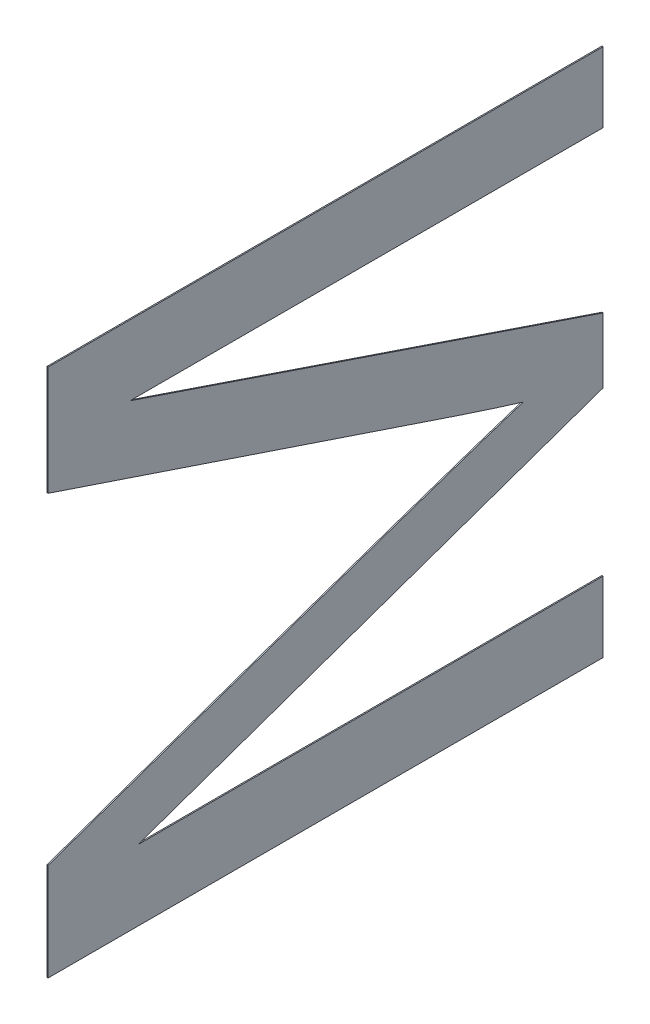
ISO-10303-21;
HEADER;
FILE_DESCRIPTION(('STEP AP214'),'2;1');
FILE_NAME('part.step','',(''),(''),'','','');
FILE_SCHEMA(('AUTOMOTIVE_DESIGN { 1 0 10303 214 1 1 1 1 }'));
ENDSEC;
DATA;
#1=APPLICATION_CONTEXT('core data for automotive mechanical design processes');
#2=APPLICATION_PROTOCOL_DEFINITION('international standard','automotive_design',2000,#1);
#3=PRODUCT_CONTEXT('',#1,'mechanical');
#4=PRODUCT('Part','Part','',(#3));
#5=PRODUCT_RELATED_PRODUCT_CATEGORY('part','',(#4));
#6=PRODUCT_DEFINITION_FORMATION('','',#4);
#7=PRODUCT_DEFINITION_CONTEXT('part definition',#1,'design');
#8=PRODUCT_DEFINITION('design','',#6,#7);
#9=PRODUCT_DEFINITION_SHAPE('','',#8);
#10=(LENGTH_UNIT() NAMED_UNIT(*) SI_UNIT(.MILLI.,.METRE.));
#11=(NAMED_UNIT(*) PLANE_ANGLE_UNIT() SI_UNIT($,.RADIAN.));
#12=(NAMED_UNIT(*) SI_UNIT($,.STERADIAN.) SOLID_ANGLE_UNIT());
#13=UNCERTAINTY_MEASURE_WITH_UNIT(LENGTH_MEASURE(1.E-05),#10,'distance_accuracy_value','');
#14=(GEOMETRIC_REPRESENTATION_CONTEXT(3) GLOBAL_UNCERTAINTY_ASSIGNED_CONTEXT((#13)) GLOBAL_UNIT_ASSIGNED_CONTEXT((#10,
#11,#12)) REPRESENTATION_CONTEXT('',''));
#15=CARTESIAN_POINT('',(0.,0.,0.));
#16=DIRECTION('',(0.,0.,1.));
#17=DIRECTION('',(1.,0.,0.));
#18=AXIS2_PLACEMENT_3D('',#15,#16,#17);
#19=CARTESIAN_POINT('',(-5.55,3.131661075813,19.957638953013));
#20=DIRECTION('',(-1.,0.,0.));
#21=DIRECTION('',(0.,-1.,0.));
#22=AXIS2_PLACEMENT_3D('',#19,#20,#21);
#23=PLANE('',#22);
#24=DIRECTION('',(0.,0.,1.));
#25=VECTOR('',#24,1.);
#26=CARTESIAN_POINT('',(-5.55,4.777331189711,17.19421221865));
#27=LINE('',#26,#25);
#28=CARTESIAN_POINT('',(-5.55,4.777331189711,22.023794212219));
#29=VERTEX_POINT('',#28);
#30=CARTESIAN_POINT('',(-5.55,4.777331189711,17.19421221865));
#31=VERTEX_POINT('',#30);
#32=EDGE_CURVE('E236',#29,#31,#27,.F.);
#33=ORIENTED_EDGE('',*,*,#32,.F.);
#34=DIRECTION('',(0.,1.,0.));
#35=VECTOR('',#34,1.);
#36=CARTESIAN_POINT('',(-5.55,4.777331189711,22.023794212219));
#37=LINE('',#36,#35);
#38=CARTESIAN_POINT('',(-5.55,3.825562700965,22.023794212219));
#39=VERTEX_POINT('',#38);
#40=EDGE_CURVE('E122',#39,#29,#37,.T.);
#41=ORIENTED_EDGE('',*,*,#40,.F.);
#42=CARTESIAN_POINT('',(-5.55,2.44614147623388,17.8887459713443));
#43=CARTESIAN_POINT('',(-5.55,2.44809287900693,17.8951206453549));
#44=CARTESIAN_POINT('',(-5.55,2.45004737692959,17.9014943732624));
#45=CARTESIAN_POINT('',(-5.55,2.45983523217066,17.933358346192));
#46=CARTESIAN_POINT('',(-5.55,2.46771464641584,17.9588344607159));
#47=CARTESIAN_POINT('',(-5.55,2.48356856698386,18.009757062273));
#48=CARTESIAN_POINT('',(-5.55,2.49154307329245,18.0352035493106));
#49=CARTESIAN_POINT('',(-5.55,2.50758154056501,18.0860683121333));
#50=CARTESIAN_POINT('',(-5.55,2.51564550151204,18.1114865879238));
#51=CARTESIAN_POINT('',(-5.55,2.52780433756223,18.1495938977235));
#52=CARTESIAN_POINT('',(-5.55,2.53186776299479,18.1622929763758));
#53=CARTESIAN_POINT('',(-5.55,2.54001489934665,18.1876846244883));
#54=CARTESIAN_POINT('',(-5.55,2.54409861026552,18.2003771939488));
#55=CARTESIAN_POINT('',(-5.55,2.55637927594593,18.2384454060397));
#56=CARTESIAN_POINT('',(-5.55,2.56460575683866,18.2638115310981));
#57=CARTESIAN_POINT('',(-5.55,2.57700046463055,18.3018427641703));
#58=CARTESIAN_POINT('',(-5.55,2.58114119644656,18.3145168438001));
#59=CARTESIAN_POINT('',(-5.55,2.59359114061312,18.3525300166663));
#60=CARTESIAN_POINT('',(-5.55,2.60192809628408,18.3778600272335));
#61=CARTESIAN_POINT('',(-5.55,2.61865762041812,18.4285016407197));
#62=CARTESIAN_POINT('',(-5.55,2.62705018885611,18.4538132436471));
#63=CARTESIAN_POINT('',(-5.55,2.6438728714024,18.5044239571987));
#64=CARTESIAN_POINT('',(-5.55,2.65230298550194,18.5297230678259));
#65=CARTESIAN_POINT('',(-5.55,2.66919054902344,18.5803121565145));
#66=CARTESIAN_POINT('',(-5.55,2.67764799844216,18.6056021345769));
#67=CARTESIAN_POINT('',(-5.55,2.69457980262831,18.6561764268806));
#68=CARTESIAN_POINT('',(-5.55,2.70305415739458,18.6814607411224));
#69=CARTESIAN_POINT('',(-5.55,2.72001465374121,18.7320254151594));
#70=CARTESIAN_POINT('',(-5.55,2.72850079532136,18.7573057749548));
#71=CARTESIAN_POINT('',(-5.55,2.74548242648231,18.8078633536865));
#72=CARTESIAN_POINT('',(-5.55,2.75397791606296,18.8331405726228));
#73=CARTESIAN_POINT('',(-5.55,2.76672334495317,18.8710556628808));
#74=CARTESIAN_POINT('',(-5.55,2.77097218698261,18.8836939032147));
#75=CARTESIAN_POINT('',(-5.55,2.78371800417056,18.9216088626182));
#76=CARTESIAN_POINT('',(-5.55,2.79221427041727,18.9468858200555));
#77=CARTESIAN_POINT('',(-5.55,2.8092032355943,18.9974409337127));
#78=CARTESIAN_POINT('',(-5.55,2.8176959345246,19.0227190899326));
#79=CARTESIAN_POINT('',(-5.55,2.83043336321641,19.0606368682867));
#80=CARTESIAN_POINT('',(-5.55,2.8346789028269,19.0732762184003));
#81=CARTESIAN_POINT('',(-5.55,2.84741477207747,19.1111945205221));
#82=CARTESIAN_POINT('',(-5.55,2.85590435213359,19.136473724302));
#83=CARTESIAN_POINT('',(-5.55,2.87288220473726,19.1870325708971));
#84=CARTESIAN_POINT('',(-5.55,2.8813704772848,19.2123122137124));
#85=CARTESIAN_POINT('',(-5.55,2.8941023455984,19.2502318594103));
#86=CARTESIAN_POINT('',(-5.55,2.89834621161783,19.262871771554));
#87=CARTESIAN_POINT('',(-5.55,2.91107765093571,19.3007915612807));
#88=CARTESIAN_POINT('',(-5.55,2.91956506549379,19.3260714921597));
#89=CARTESIAN_POINT('',(-5.55,2.93654002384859,19.3766313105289));
#90=CARTESIAN_POINT('',(-5.55,2.94502756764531,19.4019111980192));
#91=CARTESIAN_POINT('',(-5.55,2.96200341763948,19.4524707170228));
#92=CARTESIAN_POINT('',(-5.55,2.97049172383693,19.4777503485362));
#93=CARTESIAN_POINT('',(-5.55,2.98322474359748,19.5156696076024));
#94=CARTESIAN_POINT('',(-5.55,2.98746917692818,19.5283093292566));
#95=CARTESIAN_POINT('',(-5.55,3.00020271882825,19.5662284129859));
#96=CARTESIAN_POINT('',(-5.55,3.00869206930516,19.5915076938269));
#97=CARTESIAN_POINT('',(-5.55,3.02567128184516,19.6420660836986));
#98=CARTESIAN_POINT('',(-5.55,3.03416114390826,19.6673451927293));
#99=CARTESIAN_POINT('',(-5.55,3.04689621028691,19.705263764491));
#100=CARTESIAN_POINT('',(-5.55,3.05114127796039,19.7179032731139));
#101=CARTESIAN_POINT('',(-5.55,3.06387659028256,19.7558217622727));
#102=CARTESIAN_POINT('',(-5.55,3.07236694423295,19.7811007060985));
#103=CARTESIAN_POINT('',(-5.55,3.08934779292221,19.8316585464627));
#104=CARTESIAN_POINT('',(-5.55,3.09783828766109,19.8569374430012));
#105=CARTESIAN_POINT('',(-5.55,3.11057402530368,19.8948557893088));
#106=CARTESIAN_POINT('',(-5.55,3.11481927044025,19.9074952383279));
#107=CARTESIAN_POINT('',(-5.55,3.12755496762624,19.9454135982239));
#108=CARTESIAN_POINT('',(-5.55,3.1360453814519,19.9706925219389));
#109=CARTESIAN_POINT('',(-5.55,3.15302604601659,20.0212504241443));
#110=CARTESIAN_POINT('',(-5.55,3.16151629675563,20.0465294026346));
#111=CARTESIAN_POINT('',(-5.55,3.17849666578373,20.0970874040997));
#112=CARTESIAN_POINT('',(-5.55,3.18698678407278,20.1223664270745));
#113=CARTESIAN_POINT('',(-5.55,3.19972187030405,20.1602849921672));
#114=CARTESIAN_POINT('',(-5.55,3.20396688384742,20.1729245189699));
#115=CARTESIAN_POINT('',(-5.55,3.21670188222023,20.21084311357));
#116=CARTESIAN_POINT('',(-5.55,3.22519182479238,20.2361221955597));
#117=CARTESIAN_POINT('',(-5.55,3.24217161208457,20.2866803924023));
#118=CARTESIAN_POINT('',(-5.55,3.25066145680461,20.3119595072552));
#119=CARTESIAN_POINT('',(-5.55,3.26339616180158,20.3498782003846));
#120=CARTESIAN_POINT('',(-5.55,3.26764105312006,20.3625177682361));
#121=CARTESIAN_POINT('',(-5.55,3.28037569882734,20.4004364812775));
#122=CARTESIAN_POINT('',(-5.55,3.28886542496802,20.4257156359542));
#123=CARTESIAN_POINT('',(-5.55,3.3058448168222,20.4762739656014));
#124=CARTESIAN_POINT('',(-5.55,3.31433448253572,20.5015531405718));
#125=CARTESIAN_POINT('',(-5.55,3.33131376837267,20.5521115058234));
#126=CARTESIAN_POINT('',(-5.55,3.33980338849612,20.5773906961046));
#127=CARTESIAN_POINT('',(-5.55,3.35253779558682,20.6153094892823));
#128=CARTESIAN_POINT('',(-5.55,3.35678259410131,20.6279490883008));
#129=CARTESIAN_POINT('',(-5.55,3.3695169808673,20.6658678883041));
#130=CARTESIAN_POINT('',(-5.55,3.3780065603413,20.6911470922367));
#131=CARTESIAN_POINT('',(-5.55,3.39498571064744,20.7417055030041));
#132=CARTESIAN_POINT('',(-5.55,3.40347528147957,20.766984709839));
#133=CARTESIAN_POINT('',(-5.55,3.4162096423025,20.8049035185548));
#134=CARTESIAN_POINT('',(-5.55,3.42045443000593,20.8175431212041));
#135=CARTESIAN_POINT('',(-5.55,3.43318879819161,20.8554619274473));
#136=CARTESIAN_POINT('',(-5.55,3.44167838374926,20.8807411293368));
#137=CARTESIAN_POINT('',(-5.55,3.4586575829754,20.9312995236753));
#138=CARTESIAN_POINT('',(-5.55,3.46714719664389,20.9565787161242));
#139=CARTESIAN_POINT('',(-5.55,3.47988164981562,20.9944974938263));
#140=CARTESIAN_POINT('',(-5.55,3.48412647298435,21.0071370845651));
#141=CARTESIAN_POINT('',(-5.55000000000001,3.49686095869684,21.0450558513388));
#142=CARTESIAN_POINT('',(-5.55,3.50535063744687,21.0703350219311));
#143=CARTESIAN_POINT('',(-5.55,3.51808518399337,21.1082537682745));
#144=CARTESIAN_POINT('',(-5.55,3.52233003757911,21.1208933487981));
#145=CARTESIAN_POINT('',(-5.55,3.5350646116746,21.1588120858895));
#146=CARTESIAN_POINT('',(-5.55,3.54355434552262,21.1840912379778));
#147=CARTESIAN_POINT('',(-5.55,3.55628896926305,21.2220099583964));
#148=CARTESIAN_POINT('',(-5.55,3.56053384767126,21.2346495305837));
#149=CARTESIAN_POINT('',(-5.55,3.57326849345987,21.2725682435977));
#150=CARTESIAN_POINT('',(-5.55,3.58175827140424,21.2978473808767));
#151=CARTESIAN_POINT('',(-5.55,3.59449295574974,21.3357660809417));
#152=CARTESIAN_POINT('',(-5.55,3.59873785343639,21.3484056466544));
#153=CARTESIAN_POINT('',(-5.55,3.61147255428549,21.3863243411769));
#154=CARTESIAN_POINT('',(-5.55,3.61996236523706,21.4116034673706));
#155=CARTESIAN_POINT('',(-5.55,3.63694200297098,21.4621617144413));
#156=CARTESIAN_POINT('',(-5.55,3.64543182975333,21.4874408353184));
#157=CARTESIAN_POINT('',(-5.55,3.65816657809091,21.5253595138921));
#158=CARTESIAN_POINT('',(-5.55,3.66241149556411,21.5379990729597));
#159=CARTESIAN_POINT('',(-5.55,3.67514625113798,21.5759177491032));
#160=CARTESIAN_POINT('',(-5.55,3.68363609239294,21.6011968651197));
#161=CARTESIAN_POINT('',(-5.55,3.69637085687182,21.6391155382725));
#162=CARTESIAN_POINT('',(-5.55,3.70061577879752,21.6517550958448));
#163=CARTESIAN_POINT('',(-5.55,3.71335054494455,21.6896737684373));
#164=CARTESIAN_POINT('',(-5.55,3.72184038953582,21.7149528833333));
#165=CARTESIAN_POINT('',(-5.55,3.73457515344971,21.7528715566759));
#166=CARTESIAN_POINT('',(-5.55,3.73882007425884,21.7655111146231));
#167=CARTESIAN_POINT('',(-5.55,3.75155483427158,21.8034297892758));
#168=CARTESIAN_POINT('',(-5.55,3.76004467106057,21.8287089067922));
#169=CARTESIAN_POINT('',(-5.55,3.77277941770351,21.8666275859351));
#170=CARTESIAN_POINT('',(-5.55,3.77702433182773,21.8792671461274));
#171=CARTESIAN_POINT('',(-5.55000000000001,3.79603375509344,21.9358692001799));
#172=CARTESIAN_POINT('',(-5.55000000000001,3.81079824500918,21.9798317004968));
#173=CARTESIAN_POINT('',(-5.55,3.825562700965,22.023794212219));
#174=B_SPLINE_CURVE_WITH_KNOTS('',3,(#42,#43,#44,#45,#46,#47,#48,#49,#50,#51,#52,#53,#54,#55,
#56,#57,#58,#59,#60,#61,#62,#63,#64,#65,#66,#67,#68,#69,#70,#71,#72,#73,#74,#75,#76,#77,#78,#79,
#80,#81,#82,#83,#84,#85,#86,#87,#88,#89,#90,#91,#92,#93,#94,#95,#96,#97,#98,#99,#100,#101,#102,
#103,#104,#105,#106,#107,#108,#109,#110,#111,#112,#113,#114,#115,#116,#117,#118,#119,#120,#121,
#122,#123,#124,#125,#126,#127,#128,#129,#130,#131,#132,#133,#134,#135,#136,#137,#138,#139,#140,
#141,#142,#143,#144,#145,#146,#147,#148,#149,#150,#151,#152,#153,#154,#155,#156,#157,#158,#159,
#160,#161,#162,#163,#164,#165,#166,#167,#168,#169,#170,#171,#172,#173),.UNSPECIFIED.,.F.,.F.,(4,
2,2,2,2,2,2,2,2,2,2,2,2,2,2,2,2,2,2,2,2,2,2,2,2,2,2,2,2,2,2,2,2,2,2,2,2,2,2,2,2,2,2,2,2,2,2,2,2,
2,2,2,2,2,2,2,2,2,2,2,2,2,2,2,2,4),(0.,0.0200000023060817,0.100000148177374,0.180000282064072,
0.260000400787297,0.300000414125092,0.340000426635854,0.420000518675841,0.460000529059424,
0.540000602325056,0.620000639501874,0.700000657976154,0.78000066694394,0.860000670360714,
0.940000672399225,1.02000067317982,1.06000067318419,1.1400006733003,1.2200006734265,
1.26000067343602,1.34000067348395,1.42000067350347,1.46000067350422,1.5400006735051,
1.62000067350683,1.70000067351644,1.74000067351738,1.82000067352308,1.90000067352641,
1.94000067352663,2.02000067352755,2.10000067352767,2.14000067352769,2.22000067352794,
2.30000067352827,2.38000067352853,2.42000067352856,2.50000067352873,2.58000067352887,
2.62000067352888,2.70000067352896,2.78000067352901,2.86000067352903,2.90000067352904,
2.98000067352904,3.06000067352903,3.10000067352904,3.18000067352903,3.26000067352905,
3.30000067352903,3.38000067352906,3.42000067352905,3.50000067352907,3.54000067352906,
3.62000067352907,3.66000067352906,3.74000067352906,3.82000067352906,3.86000067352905,
3.94000067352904,3.98000067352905,4.06000067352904,4.10000067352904,4.18000067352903,
4.22000067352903,4.35912732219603),.UNSPECIFIED.);
#175=CARTESIAN_POINT('',(-5.55,2.44614147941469,17.8887459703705));
#176=VERTEX_POINT('',#175);
#177=EDGE_CURVE('E121',#176,#39,#174,.T.);
#178=ORIENTED_EDGE('',*,*,#177,.F.);
#179=CARTESIAN_POINT('',(-5.55,1.021704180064,22.023794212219));
#180=CARTESIAN_POINT('',(-5.55,1.02389174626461,22.0174966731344));
#181=CARTESIAN_POINT('',(-5.55,1.02607955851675,22.0111992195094));
#182=CARTESIAN_POINT('',(-5.55,1.03701982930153,21.9797123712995));
#183=CARTESIAN_POINT('',(-5.55,1.04577591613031,21.9545242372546));
#184=CARTESIAN_POINT('',(-5.55,1.05891545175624,21.9167439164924));
#185=CARTESIAN_POINT('',(-5.55,1.06329619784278,21.9041507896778));
#186=CARTESIAN_POINT('',(-5.55,1.07644103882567,21.8663723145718));
#187=CARTESIAN_POINT('',(-5.55,1.08520773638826,21.8411878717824));
#188=CARTESIAN_POINT('',(-5.55,1.09836258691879,21.8034128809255));
#189=CARTESIAN_POINT('',(-5.55,1.10274833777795,21.7908214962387));
#190=CARTESIAN_POINT('',(-5.55,1.11590789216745,21.7530481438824));
#191=CARTESIAN_POINT('',(-5.55,1.12468399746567,21.7278669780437));
#192=CARTESIAN_POINT('',(-5.55,1.13785235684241,21.6900966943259));
#193=CARTESIAN_POINT('',(-5.55,1.14224251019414,21.6775068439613));
#194=CARTESIAN_POINT('',(-5.55,1.15541497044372,21.6397379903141));
#195=CARTESIAN_POINT('',(-5.55,1.16419927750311,21.6145596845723));
#196=CARTESIAN_POINT('',(-5.55,1.17737933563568,21.5767934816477));
#197=CARTESIAN_POINT('',(-5.55,1.181773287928,21.5642049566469));
#198=CARTESIAN_POINT('',(-5.55,1.19495684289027,21.5264399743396));
#199=CARTESIAN_POINT('',(-5.55,1.20374814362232,21.5012641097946));
#200=CARTESIAN_POINT('',(-5.55,1.221334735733,21.4509137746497));
#201=CARTESIAN_POINT('',(-5.55,1.23013002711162,21.4257393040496));
#202=CARTESIAN_POINT('',(-5.55,1.24332555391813,21.3879785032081));
#203=CARTESIAN_POINT('',(-5.55,1.24772449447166,21.3753917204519));
#204=CARTESIAN_POINT('',(-5.55,1.26092251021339,21.3376317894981));
#205=CARTESIAN_POINT('',(-5.55,1.26972277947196,21.312459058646));
#206=CARTESIAN_POINT('',(-5.55,1.28292516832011,21.2747006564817));
#207=CARTESIAN_POINT('',(-5.55,1.28732629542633,21.2621146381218));
#208=CARTESIAN_POINT('',(-5.55,1.30053056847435,21.2243568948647));
#209=CARTESIAN_POINT('',(-5.55,1.30933460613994,21.1991854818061));
#210=CARTESIAN_POINT('',(-5.55,1.32254204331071,21.1614288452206));
#211=CARTESIAN_POINT('',(-5.55,1.32694475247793,21.1488433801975));
#212=CARTESIAN_POINT('',(-5.55,1.34015346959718,21.1110871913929));
#213=CARTESIAN_POINT('',(-5.55,1.34896006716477,21.0859166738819));
#214=CARTESIAN_POINT('',(-5.55,1.36217074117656,21.0481611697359));
#215=CARTESIAN_POINT('',(-5.55,1.36657442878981,21.0355760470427));
#216=CARTESIAN_POINT('',(-5.55,1.37978577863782,20.9978207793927));
#217=CARTESIAN_POINT('',(-5.55,1.38859372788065,20.9726507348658));
#218=CARTESIAN_POINT('',(-5.55,1.40620987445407,20.9223107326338));
#219=CARTESIAN_POINT('',(-5.55,1.41501807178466,20.8971407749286));
#220=CARTESIAN_POINT('',(-5.55,1.42823017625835,20.8593857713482));
#221=CARTESIAN_POINT('',(-5.55,1.43263417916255,20.8468007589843));
#222=CARTESIAN_POINT('',(-5.55,1.4458459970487,20.8090456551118));
#223=CARTESIAN_POINT('',(-5.55,1.45465362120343,20.7838754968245));
#224=CARTESIAN_POINT('',(-5.55,1.47226785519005,20.7335348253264));
#225=CARTESIAN_POINT('',(-5.55,1.48107446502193,20.7083643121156));
#226=CARTESIAN_POINT('',(-5.55,1.49868616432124,20.6580227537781));
#227=CARTESIAN_POINT('',(-5.55,1.50749125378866,20.6328517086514));
#228=CARTESIAN_POINT('',(-5.55,1.5206973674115,20.5950946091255));
#229=CARTESIAN_POINT('',(-5.55,1.5250991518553,20.5825088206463));
#230=CARTESIAN_POINT('',(-5.55,1.53830364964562,20.5447511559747));
#231=CARTESIAN_POINT('',(-5.55,1.54710550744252,20.5195789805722));
#232=CARTESIAN_POINT('',(-5.55,1.56470643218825,20.4692336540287));
#233=CARTESIAN_POINT('',(-5.55,1.57350549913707,20.4440605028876));
#234=CARTESIAN_POINT('',(-5.55,1.5867016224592,20.4062999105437));
#235=CARTESIAN_POINT('',(-5.55,1.59109991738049,20.3937129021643));
#236=CARTESIAN_POINT('',(-5.55,1.60429346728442,20.3559514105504));
#237=CARTESIAN_POINT('',(-5.55,1.61308738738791,20.330776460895));
#238=CARTESIAN_POINT('',(-5.55,1.63067115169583,20.2804251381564));
#239=CARTESIAN_POINT('',(-5.55,1.63946099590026,20.2552487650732));
#240=CARTESIAN_POINT('',(-5.55,1.65703608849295,20.2048944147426));
#241=CARTESIAN_POINT('',(-5.55,1.66582133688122,20.1797164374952));
#242=CARTESIAN_POINT('',(-5.55,1.6789953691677,20.1419481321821));
#243=CARTESIAN_POINT('',(-5.55,1.68338607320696,20.1293584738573));
#244=CARTESIAN_POINT('',(-5.55,1.69655616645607,20.0915887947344));
#245=CARTESIAN_POINT('',(-5.55,1.70533353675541,20.0664080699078));
#246=CARTESIAN_POINT('',(-5.55,1.72288236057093,20.0160445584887));
#247=CARTESIAN_POINT('',(-5.55,1.73165381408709,19.9908617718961));
#248=CARTESIAN_POINT('',(-5.55,1.74480615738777,19.9530859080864));
#249=CARTESIAN_POINT('',(-5.55,1.74918946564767,19.9404936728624));
#250=CARTESIAN_POINT('',(-5.55,1.76233684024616,19.9027160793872));
#251=CARTESIAN_POINT('',(-5.55,1.77109835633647,19.8775298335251));
#252=CARTESIAN_POINT('',(-5.55,1.78861387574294,19.8271547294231));
#253=CARTESIAN_POINT('',(-5.55,1.79736787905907,19.8019658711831));
#254=CARTESIAN_POINT('',(-5.55,1.81049274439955,19.7641804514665));
#255=CARTESIAN_POINT('',(-5.55,1.81486667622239,19.7515849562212));
#256=CARTESIAN_POINT('',(-5.55,1.82798528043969,19.7137973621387));
#257=CARTESIAN_POINT('',(-5.55,1.83672676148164,19.6886041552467));
#258=CARTESIAN_POINT('',(-5.55,1.8542005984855,19.638214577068));
#259=CARTESIAN_POINT('',(-5.55,1.8629329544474,19.6130182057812));
#260=CARTESIAN_POINT('',(-5.55,1.88038797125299,19.5626221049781));
#261=CARTESIAN_POINT('',(-5.55,1.88911063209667,19.5374223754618));
#262=CARTESIAN_POINT('',(-5.55,1.90218697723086,19.4996201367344));
#263=CARTESIAN_POINT('',(-5.55,1.90654448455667,19.4870189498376));
#264=CARTESIAN_POINT('',(-5.55,1.9196130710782,19.4492140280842));
#265=CARTESIAN_POINT('',(-5.55,1.92832021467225,19.4240089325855));
#266=CARTESIAN_POINT('',(-5.55,1.94572388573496,19.3735950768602));
#267=CARTESIAN_POINT('',(-5.55,1.95442041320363,19.3483863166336));
#268=CARTESIAN_POINT('',(-5.55,1.9718028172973,19.2979651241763));
#269=CARTESIAN_POINT('',(-5.55,1.98048869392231,19.2727526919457));
#270=CARTESIAN_POINT('',(-5.55,1.99350931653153,19.2349312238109));
#271=CARTESIAN_POINT('',(-5.55,1.99784815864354,19.2223235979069));
#272=CARTESIAN_POINT('',(-5.55,2.0108605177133,19.1844992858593));
#273=CARTESIAN_POINT('',(-5.55,2.01952986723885,19.1592811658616));
#274=CARTESIAN_POINT('',(-5.55,2.03685692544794,19.1088409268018));
#275=CARTESIAN_POINT('',(-5.55,2.04551463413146,19.0836188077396));
#276=CARTESIAN_POINT('',(-5.55,2.05849187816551,19.0457824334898));
#277=CARTESIAN_POINT('',(-5.55,2.06281607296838,19.0331697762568));
#278=CARTESIAN_POINT('',(-5.55,2.07578381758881,18.9953301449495));
#279=CARTESIAN_POINT('',(-5.55,2.08442252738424,18.9701015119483));
#280=CARTESIAN_POINT('',(-5.55,2.10168579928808,18.9196394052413));
#281=CARTESIAN_POINT('',(-5.55,2.11031036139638,18.8944059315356));
#282=CARTESIAN_POINT('',(-5.55,2.12323510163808,18.8565515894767));
#283=CARTESIAN_POINT('',(-5.55,2.12754133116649,18.8439327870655));
#284=CARTESIAN_POINT('',(-5.55,2.14045396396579,18.8060743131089));
#285=CARTESIAN_POINT('',(-5.55,2.14905431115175,18.7808325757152));
#286=CARTESIAN_POINT('',(-5.55,2.16624079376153,18.7303442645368));
#287=CARTESIAN_POINT('',(-5.55,2.17482692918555,18.7050976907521));
#288=CARTESIAN_POINT('',(-5.55,2.19198874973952,18.6546009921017));
#289=CARTESIAN_POINT('',(-5.55,2.20056443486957,18.629350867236));
#290=CARTESIAN_POINT('',(-5.55,2.21770460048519,18.5788468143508));
#291=CARTESIAN_POINT('',(-5.55,2.22626908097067,18.5535928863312));
#292=CARTESIAN_POINT('',(-5.55,2.24338425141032,18.5030803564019));
#293=CARTESIAN_POINT('',(-5.55,2.25193494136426,18.477821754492));
#294=CARTESIAN_POINT('',(-5.55,2.26901864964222,18.4272985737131));
#295=CARTESIAN_POINT('',(-5.55,2.27755166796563,18.4020339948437));
#296=CARTESIAN_POINT('',(-5.55,2.29459270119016,18.3514963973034));
#297=CARTESIAN_POINT('',(-5.55,2.30310071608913,18.3262233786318));
#298=CARTESIAN_POINT('',(-5.55,2.31583498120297,18.2883045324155));
#299=CARTESIAN_POINT('',(-5.55,2.32007510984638,18.2756633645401));
#300=CARTESIAN_POINT('',(-5.55,2.33277901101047,18.2377343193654));
#301=CARTESIAN_POINT('',(-5.55,2.34122629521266,18.2124409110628));
#302=CARTESIAN_POINT('',(-5.55,2.3538498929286,18.1744850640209));
#303=CARTESIAN_POINT('',(-5.55,2.35804987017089,18.1618304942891));
#304=CARTESIAN_POINT('',(-5.55,2.36643087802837,18.1365150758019));
#305=CARTESIAN_POINT('',(-5.55,2.37061190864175,18.123854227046));
#306=CARTESIAN_POINT('',(-5.55,2.37895114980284,18.0985250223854));
#307=CARTESIAN_POINT('',(-5.55,2.38310936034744,18.0858566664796));
#308=CARTESIAN_POINT('',(-5.55,2.39554409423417,18.047838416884));
#309=CARTESIAN_POINT('',(-5.55,2.40378069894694,18.0224754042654));
#310=CARTESIAN_POINT('',(-5.55,2.42352328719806,17.9610319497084));
#311=CARTESIAN_POINT('',(-5.55,2.43494894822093,17.9249257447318));
#312=CARTESIAN_POINT('',(-5.55000000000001,2.44614148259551,17.8887459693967));
#313=B_SPLINE_CURVE_WITH_KNOTS('',3,(#179,#180,#181,#182,#183,#184,#185,#186,#187,#188,#189,
#190,#191,#192,#193,#194,#195,#196,#197,#198,#199,#200,#201,#202,#203,#204,#205,#206,#207,#208,
#209,#210,#211,#212,#213,#214,#215,#216,#217,#218,#219,#220,#221,#222,#223,#224,#225,#226,#227,
#228,#229,#230,#231,#232,#233,#234,#235,#236,#237,#238,#239,#240,#241,#242,#243,#244,#245,#246,
#247,#248,#249,#250,#251,#252,#253,#254,#255,#256,#257,#258,#259,#260,#261,#262,#263,#264,#265,
#266,#267,#268,#269,#270,#271,#272,#273,#274,#275,#276,#277,#278,#279,#280,#281,#282,#283,#284,
#285,#286,#287,#288,#289,#290,#291,#292,#293,#294,#295,#296,#297,#298,#299,#300,#301,#302,#303,
#304,#305,#306,#307,#308,#309,#310,#311,#312),.UNSPECIFIED.,.F.,.F.,(4,2,2,2,2,2,2,2,2,2,2,2,2,
2,2,2,2,2,2,2,2,2,2,2,2,2,2,2,2,2,2,2,2,2,2,2,2,2,2,2,2,2,2,2,2,2,2,2,2,2,2,2,2,2,2,2,2,2,2,2,2,
2,2,2,2,2,4),(0.,0.0200000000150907,0.100000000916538,0.140000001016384,0.220000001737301,
0.260000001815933,0.340000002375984,0.380000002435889,0.460000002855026,0.500000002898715,
0.580000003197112,0.66000000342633,0.700000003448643,0.780000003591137,0.820000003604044,
0.900000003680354,0.940000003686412,1.02000000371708,1.06000000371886,1.14000000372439,
1.22000000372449,1.26000000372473,1.34000000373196,1.42000000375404,1.50000000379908,
1.54000000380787,1.6200000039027,1.70000000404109,1.74000000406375,1.82000000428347,
1.90000000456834,1.98000000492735,2.02000000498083,2.1000000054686,2.18000000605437,
2.22000000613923,2.30000000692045,2.38000000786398,2.42000000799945,2.50000000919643,
2.58000001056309,2.66000001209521,2.70000001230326,2.78000001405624,2.86000001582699,
2.94000001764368,2.98000001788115,3.0600000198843,3.14000002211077,3.18000002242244,
3.26000002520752,3.34000002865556,3.38000002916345,3.46000003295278,3.54000003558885,
3.62000003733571,3.70000003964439,3.78000004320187,3.86000004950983,3.94000006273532,
3.98000006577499,4.060000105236,4.10000011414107,4.14000012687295,4.18000014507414,
4.26000038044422,4.37361220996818),.UNSPECIFIED.);
#314=CARTESIAN_POINT('',(-5.55,1.021704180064,22.023794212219));
#315=VERTEX_POINT('',#314);
#316=EDGE_CURVE('E24',#315,#176,#313,.T.);
#317=ORIENTED_EDGE('',*,*,#316,.F.);
#318=DIRECTION('',(0.,1.,0.));
#319=VECTOR('',#318,1.);
#320=CARTESIAN_POINT('',(-5.55,1.021704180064,22.023794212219));
#321=LINE('',#320,#319);
#322=CARTESIAN_POINT('',(-5.55,0.172829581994,22.023794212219));
#323=VERTEX_POINT('',#322);
#324=EDGE_CURVE('E147',#323,#315,#321,.T.);
#325=ORIENTED_EDGE('',*,*,#324,.F.);
#326=DIRECTION('',(0.,0.,1.));
#327=VECTOR('',#326,1.);
#328=CARTESIAN_POINT('',(-5.55,0.172829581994,22.023794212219));
#329=LINE('',#328,#327);
#330=CARTESIAN_POINT('',(-5.55,0.172829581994,17.19421221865));
#331=VERTEX_POINT('',#330);
#332=EDGE_CURVE('E160',#331,#323,#329,.T.);
#333=ORIENTED_EDGE('',*,*,#332,.F.);
#334=DIRECTION('',(0.,1.,0.));
#335=VECTOR('',#334,1.);
#336=CARTESIAN_POINT('',(-5.55,0.172829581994,17.19421221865));
#337=LINE('',#336,#335);
#338=CARTESIAN_POINT('',(-5.55,0.786977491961,17.19421221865));
#339=VERTEX_POINT('',#338);
#340=EDGE_CURVE('E171',#339,#331,#337,.F.);
#341=ORIENTED_EDGE('',*,*,#340,.F.);
#342=DIRECTION('',(0.,0.,1.));
#343=VECTOR('',#342,1.);
#344=CARTESIAN_POINT('',(-5.55,0.786977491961,17.19421221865));
#345=LINE('',#344,#343);
#346=CARTESIAN_POINT('',(-5.55,0.786977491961,21.242443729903));
#347=VERTEX_POINT('',#346);
#348=EDGE_CURVE('E182',#347,#339,#345,.F.);
#349=ORIENTED_EDGE('',*,*,#348,.F.);
#350=DIRECTION('',(0.,0.330584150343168,-0.943776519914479));
#351=VECTOR('',#350,1.);
#352=CARTESIAN_POINT('',(-5.55,0.786977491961,21.242443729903));
#353=LINE('',#352,#351);
#354=CARTESIAN_POINT('',(-5.55,2.20498392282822,17.1942122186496));
#355=VERTEX_POINT('',#354);
#356=EDGE_CURVE('E193',#355,#347,#353,.F.);
#357=ORIENTED_EDGE('',*,*,#356,.F.);
#358=DIRECTION('',(0.,1.,0.));
#359=VECTOR('',#358,1.);
#360=CARTESIAN_POINT('',(-5.55,2.20498392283,17.19421221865));
#361=LINE('',#360,#359);
#362=CARTESIAN_POINT('',(-5.55,2.770900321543,17.19421221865));
#363=VERTEX_POINT('',#362);
#364=EDGE_CURVE('E204',#363,#355,#361,.F.);
#365=ORIENTED_EDGE('',*,*,#364,.F.);
#366=DIRECTION('',(0.,0.321106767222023,0.947043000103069));
#367=VECTOR('',#366,1.);
#368=CARTESIAN_POINT('',(-5.55,2.770900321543,17.19421221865));
#369=LINE('',#368,#367);
#370=CARTESIAN_POINT('',(-5.55,4.16639871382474,21.3099678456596));
#371=VERTEX_POINT('',#370);
#372=EDGE_CURVE('E215',#371,#363,#369,.F.);
#373=ORIENTED_EDGE('',*,*,#372,.F.);
#374=DIRECTION('',(0.,0.,1.));
#375=VECTOR('',#374,1.);
#376=CARTESIAN_POINT('',(-5.55,4.166398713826,21.309967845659));
#377=LINE('',#376,#375);
#378=CARTESIAN_POINT('',(-5.55,4.166398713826,17.19421221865));
#379=VERTEX_POINT('',#378);
#380=EDGE_CURVE('E226',#379,#371,#377,.T.);
#381=ORIENTED_EDGE('',*,*,#380,.F.);
#382=DIRECTION('',(0.,1.,0.));
#383=VECTOR('',#382,1.);
#384=CARTESIAN_POINT('',(-5.55,4.166398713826,17.19421221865));
#385=LINE('',#384,#383);
#386=EDGE_CURVE('E245',#31,#379,#385,.F.);
#387=ORIENTED_EDGE('',*,*,#386,.F.);
#388=EDGE_LOOP('',(#33,#41,#178,#317,#325,#333,#341,#349,#357,#365,#373,#381,#387));
#389=FACE_BOUND('',#388,.T.);
#390=ADVANCED_FACE('F17',(#389),#23,.F.);
#391=CARTESIAN_POINT('',(-5.56,4.166398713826,17.19421221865));
#392=DIRECTION('',(0.,0.,-1.));
#393=DIRECTION('',(-1.,0.,0.));
#394=AXIS2_PLACEMENT_3D('',#391,#392,#393);
#395=PLANE('',#394);
#396=DIRECTION('',(0.,-1.,0.));
#397=VECTOR('',#396,1.);
#398=CARTESIAN_POINT('',(-5.56,3.131661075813,17.19421221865));
#399=LINE('',#398,#397);
#400=CARTESIAN_POINT('',(-5.56,4.777331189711,17.19421221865));
#401=VERTEX_POINT('',#400);
#402=CARTESIAN_POINT('',(-5.56,4.166398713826,17.19421221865));
#403=VERTEX_POINT('',#402);
#404=EDGE_CURVE('E220',#401,#403,#399,.T.);
#405=ORIENTED_EDGE('',*,*,#404,.F.);
#406=DIRECTION('',(-1.,0.,0.));
#407=VECTOR('',#406,1.);
#408=CARTESIAN_POINT('',(-5.56,4.777331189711,17.19421221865));
#409=LINE('',#408,#407);
#410=EDGE_CURVE('E233',#31,#401,#409,.T.);
#411=ORIENTED_EDGE('',*,*,#410,.F.);
#412=ORIENTED_EDGE('',*,*,#386,.T.);
#413=DIRECTION('',(1.,0.,0.));
#414=VECTOR('',#413,1.);
#415=CARTESIAN_POINT('',(-5.56,4.166398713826,17.19421221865));
#416=LINE('',#415,#414);
#417=EDGE_CURVE('E223',#403,#379,#416,.T.);
#418=ORIENTED_EDGE('',*,*,#417,.F.);
#419=EDGE_LOOP('',(#405,#411,#412,#418));
#420=FACE_BOUND('',#419,.T.);
#421=ADVANCED_FACE('F336',(#420),#395,.T.);
#422=CARTESIAN_POINT('',(-5.56,4.166398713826,21.309967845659));
#423=DIRECTION('',(0.,-1.,0.));
#424=DIRECTION('',(1.,0.,0.));
#425=AXIS2_PLACEMENT_3D('',#422,#423,#424);
#426=PLANE('',#425);
#427=DIRECTION('',(0.,0.,1.));
#428=VECTOR('',#427,1.);
#429=CARTESIAN_POINT('',(-5.56,4.166398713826,19.957638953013));
#430=LINE('',#429,#428);
#431=CARTESIAN_POINT('',(-5.56,4.16639871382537,21.3099678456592));
#432=VERTEX_POINT('',#431);
#433=EDGE_CURVE('E209',#403,#432,#430,.T.);
#434=ORIENTED_EDGE('',*,*,#433,.F.);
#435=ORIENTED_EDGE('',*,*,#417,.T.);
#436=ORIENTED_EDGE('',*,*,#380,.T.);
#437=DIRECTION('',(1.,0.,0.));
#438=VECTOR('',#437,1.);
#439=CARTESIAN_POINT('',(-5.56,4.16639871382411,21.3099678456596));
#440=LINE('',#439,#438);
#441=EDGE_CURVE('E212',#432,#371,#440,.T.);
#442=ORIENTED_EDGE('',*,*,#441,.F.);
#443=EDGE_LOOP('',(#434,#435,#436,#442));
#444=FACE_BOUND('',#443,.T.);
#445=ADVANCED_FACE('F332',(#444),#426,.T.);
#446=CARTESIAN_POINT('',(-5.56,2.770900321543,17.19421221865));
#447=DIRECTION('',(0.,0.947043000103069,-0.321106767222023));
#448=DIRECTION('',(0.,0.321106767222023,0.947043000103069));
#449=AXIS2_PLACEMENT_3D('',#446,#447,#448);
#450=PLANE('',#449);
#451=DIRECTION('',(0.,-0.321106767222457,-0.947043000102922));
#452=VECTOR('',#451,1.);
#453=CARTESIAN_POINT('',(-5.56,4.166398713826,21.309967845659));
#454=LINE('',#453,#452);
#455=CARTESIAN_POINT('',(-5.56,2.770900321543,17.19421221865));
#456=VERTEX_POINT('',#455);
#457=EDGE_CURVE('E198',#432,#456,#454,.T.);
#458=ORIENTED_EDGE('',*,*,#457,.F.);
#459=ORIENTED_EDGE('',*,*,#441,.T.);
#460=ORIENTED_EDGE('',*,*,#372,.T.);
#461=DIRECTION('',(-1.,0.,0.));
#462=VECTOR('',#461,1.);
#463=CARTESIAN_POINT('',(-5.56,2.770900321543,17.19421221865));
#464=LINE('',#463,#462);
#465=EDGE_CURVE('E201',#456,#363,#464,.F.);
#466=ORIENTED_EDGE('',*,*,#465,.F.);
#467=EDGE_LOOP('',(#458,#459,#460,#466));
#468=FACE_BOUND('',#467,.T.);
#469=ADVANCED_FACE('F328',(#468),#450,.T.);
#470=CARTESIAN_POINT('',(-5.56,2.20498392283,17.19421221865));
#471=DIRECTION('',(0.,0.,-1.));
#472=DIRECTION('',(-1.,0.,0.));
#473=AXIS2_PLACEMENT_3D('',#470,#471,#472);
#474=PLANE('',#473);
#475=DIRECTION('',(0.,-1.,0.));
#476=VECTOR('',#475,1.);
#477=CARTESIAN_POINT('',(-5.56,3.131661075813,17.19421221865));
#478=LINE('',#477,#476);
#479=CARTESIAN_POINT('',(-5.56,2.20498392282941,17.1942122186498));
#480=VERTEX_POINT('',#479);
#481=EDGE_CURVE('E187',#456,#480,#478,.T.);
#482=ORIENTED_EDGE('',*,*,#481,.F.);
#483=ORIENTED_EDGE('',*,*,#465,.T.);
#484=ORIENTED_EDGE('',*,*,#364,.T.);
#485=DIRECTION('',(1.,0.,0.));
#486=VECTOR('',#485,1.);
#487=CARTESIAN_POINT('',(-5.56,2.20498392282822,17.1942122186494));
#488=LINE('',#487,#486);
#489=EDGE_CURVE('E190',#480,#355,#488,.T.);
#490=ORIENTED_EDGE('',*,*,#489,.F.);
#491=EDGE_LOOP('',(#482,#483,#484,#490));
#492=FACE_BOUND('',#491,.T.);
#493=ADVANCED_FACE('F324',(#492),#474,.T.);
#494=CARTESIAN_POINT('',(-5.56,0.786977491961,21.242443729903));
#495=DIRECTION('',(0.,-0.943776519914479,-0.330584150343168));
#496=DIRECTION('',(0.,0.330584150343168,-0.943776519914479));
#497=AXIS2_PLACEMENT_3D('',#494,#495,#496);
#498=PLANE('',#497);
#499=DIRECTION('',(0.,-0.330584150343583,0.943776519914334));
#500=VECTOR('',#499,1.);
#501=CARTESIAN_POINT('',(-5.56,2.20498392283,17.19421221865));
#502=LINE('',#501,#500);
#503=CARTESIAN_POINT('',(-5.56,0.786977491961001,21.242443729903));
#504=VERTEX_POINT('',#503);
#505=EDGE_CURVE('E176',#480,#504,#502,.T.);
#506=ORIENTED_EDGE('',*,*,#505,.F.);
#507=ORIENTED_EDGE('',*,*,#489,.T.);
#508=ORIENTED_EDGE('',*,*,#356,.T.);
#509=DIRECTION('',(-1.,0.,0.));
#510=VECTOR('',#509,1.);
#511=CARTESIAN_POINT('',(-5.56,0.786977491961,21.242443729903));
#512=LINE('',#511,#510);
#513=EDGE_CURVE('E179',#504,#347,#512,.F.);
#514=ORIENTED_EDGE('',*,*,#513,.F.);
#515=EDGE_LOOP('',(#506,#507,#508,#514));
#516=FACE_BOUND('',#515,.T.);
#517=ADVANCED_FACE('F320',(#516),#498,.T.);
#518=CARTESIAN_POINT('',(-5.56,0.786977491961,17.19421221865));
#519=DIRECTION('',(0.,1.,0.));
#520=DIRECTION('',(-1.,0.,0.));
#521=AXIS2_PLACEMENT_3D('',#518,#519,#520);
#522=PLANE('',#521);
#523=DIRECTION('',(0.,0.,1.));
#524=VECTOR('',#523,1.);
#525=CARTESIAN_POINT('',(-5.56,0.786977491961,19.957638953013));
#526=LINE('',#525,#524);
#527=CARTESIAN_POINT('',(-5.56,0.786977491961,17.19421221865));
#528=VERTEX_POINT('',#527);
#529=EDGE_CURVE('E165',#504,#528,#526,.F.);
#530=ORIENTED_EDGE('',*,*,#529,.F.);
#531=ORIENTED_EDGE('',*,*,#513,.T.);
#532=ORIENTED_EDGE('',*,*,#348,.T.);
#533=DIRECTION('',(-1.,0.,0.));
#534=VECTOR('',#533,1.);
#535=CARTESIAN_POINT('',(-5.56,0.786977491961,17.19421221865));
#536=LINE('',#535,#534);
#537=EDGE_CURVE('E168',#528,#339,#536,.F.);
#538=ORIENTED_EDGE('',*,*,#537,.F.);
#539=EDGE_LOOP('',(#530,#531,#532,#538));
#540=FACE_BOUND('',#539,.T.);
#541=ADVANCED_FACE('F316',(#540),#522,.T.);
#542=CARTESIAN_POINT('',(-5.56,0.172829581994,17.19421221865));
#543=DIRECTION('',(0.,0.,-1.));
#544=DIRECTION('',(-1.,0.,0.));
#545=AXIS2_PLACEMENT_3D('',#542,#543,#544);
#546=PLANE('',#545);
#547=DIRECTION('',(0.,-1.,0.));
#548=VECTOR('',#547,1.);
#549=CARTESIAN_POINT('',(-5.56,3.131661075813,17.19421221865));
#550=LINE('',#549,#548);
#551=CARTESIAN_POINT('',(-5.56,0.172829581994,17.19421221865));
#552=VERTEX_POINT('',#551);
#553=EDGE_CURVE('E154',#528,#552,#550,.T.);
#554=ORIENTED_EDGE('',*,*,#553,.F.);
#555=ORIENTED_EDGE('',*,*,#537,.T.);
#556=ORIENTED_EDGE('',*,*,#340,.T.);
#557=DIRECTION('',(1.,0.,0.));
#558=VECTOR('',#557,1.);
#559=CARTESIAN_POINT('',(-5.56,0.172829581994,17.19421221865));
#560=LINE('',#559,#558);
#561=EDGE_CURVE('E157',#552,#331,#560,.T.);
#562=ORIENTED_EDGE('',*,*,#561,.F.);
#563=EDGE_LOOP('',(#554,#555,#556,#562));
#564=FACE_BOUND('',#563,.T.);
#565=ADVANCED_FACE('F312',(#564),#546,.T.);
#566=CARTESIAN_POINT('',(-5.56,0.172829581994,22.023794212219));
#567=DIRECTION('',(0.,-1.,0.));
#568=DIRECTION('',(1.,0.,0.));
#569=AXIS2_PLACEMENT_3D('',#566,#567,#568);
#570=PLANE('',#569);
#571=DIRECTION('',(0.,0.,1.));
#572=VECTOR('',#571,1.);
#573=CARTESIAN_POINT('',(-5.56,0.172829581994,19.957638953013));
#574=LINE('',#573,#572);
#575=CARTESIAN_POINT('',(-5.56,0.172829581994,22.023794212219));
#576=VERTEX_POINT('',#575);
#577=EDGE_CURVE('E150',#552,#576,#574,.T.);
#578=ORIENTED_EDGE('',*,*,#577,.F.);
#579=ORIENTED_EDGE('',*,*,#561,.T.);
#580=ORIENTED_EDGE('',*,*,#332,.T.);
#581=DIRECTION('',(1.,0.,0.));
#582=VECTOR('',#581,1.);
#583=CARTESIAN_POINT('',(-5.56,0.172829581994,22.023794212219));
#584=LINE('',#583,#582);
#585=EDGE_CURVE('E133',#576,#323,#584,.T.);
#586=ORIENTED_EDGE('',*,*,#585,.F.);
#587=EDGE_LOOP('',(#578,#579,#580,#586));
#588=FACE_BOUND('',#587,.T.);
#589=ADVANCED_FACE('F308',(#588),#570,.T.);
#590=CARTESIAN_POINT('',(-5.56,1.021704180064,22.023794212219));
#591=DIRECTION('',(0.,0.,1.));
#592=DIRECTION('',(1.,0.,0.));
#593=AXIS2_PLACEMENT_3D('',#590,#591,#592);
#594=PLANE('',#593);
#595=DIRECTION('',(0.,-1.,0.));
#596=VECTOR('',#595,1.);
#597=CARTESIAN_POINT('',(-5.56,3.131661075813,22.023794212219));
#598=LINE('',#597,#596);
#599=CARTESIAN_POINT('',(-5.56,1.021704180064,22.023794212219));
#600=VERTEX_POINT('',#599);
#601=EDGE_CURVE('E153',#576,#600,#598,.F.);
#602=ORIENTED_EDGE('',*,*,#601,.F.);
#603=ORIENTED_EDGE('',*,*,#585,.T.);
#604=ORIENTED_EDGE('',*,*,#324,.T.);
#605=DIRECTION('',(1.,0.,0.));
#606=VECTOR('',#605,1.);
#607=CARTESIAN_POINT('',(-5.555,1.021704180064,22.023794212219));
#608=LINE('',#607,#606);
#609=EDGE_CURVE('E127',#600,#315,#608,.T.);
#610=ORIENTED_EDGE('',*,*,#609,.F.);
#611=EDGE_LOOP('',(#602,#603,#604,#610));
#612=FACE_BOUND('',#611,.T.);
#613=ADVANCED_FACE('F305',(#612),#594,.T.);
#614=CARTESIAN_POINT('',(-5.56,2.446141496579,17.888745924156));
#615=CARTESIAN_POINT('',(-5.55,2.446141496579,17.888745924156));
#616=CARTESIAN_POINT('',(-5.56,2.409542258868,18.007155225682));
#617=CARTESIAN_POINT('',(-5.55,2.409542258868,18.007155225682));
#618=CARTESIAN_POINT('',(-5.56,2.338420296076,18.222887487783));
#619=CARTESIAN_POINT('',(-5.55,2.338420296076,18.222887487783));
#620=CARTESIAN_POINT('',(-5.56,2.181646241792,18.685284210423));
#621=CARTESIAN_POINT('',(-5.55,2.181646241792,18.685284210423));
#622=CARTESIAN_POINT('',(-5.56,2.073868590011,19.001488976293));
#623=CARTESIAN_POINT('',(-5.55,2.073868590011,19.001488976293));
#624=CARTESIAN_POINT('',(-5.56,1.920901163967,19.446304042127));
#625=CARTESIAN_POINT('',(-5.55,1.920901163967,19.446304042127));
#626=CARTESIAN_POINT('',(-5.56,1.683754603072,20.129417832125));
#627=CARTESIAN_POINT('',(-5.55,1.683754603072,20.129417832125));
#628=CARTESIAN_POINT('',(-5.56,1.381706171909,20.992169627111));
#629=CARTESIAN_POINT('',(-5.55,1.381706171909,20.992169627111));
#630=CARTESIAN_POINT('',(-5.56,1.141298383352,21.67950786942));
#631=CARTESIAN_POINT('',(-5.55,1.141298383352,21.67950786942));
#632=CARTESIAN_POINT('',(-5.56,1.021704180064,22.023794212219));
#633=CARTESIAN_POINT('',(-5.55,1.021704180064,22.023794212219));
#634=B_SPLINE_SURFACE_WITH_KNOTS('',3,1,((#614,#615),(#616,#617),(#618,#619),(#620,#621),(#622,
#623),(#624,#625),(#626,#627),(#628,#629),(#630,#631),(#632,#633)),.UNSPECIFIED.,.F.,.F.,.F.,(4,
1,1,1,1,1,1,4),(2,2),(0.261468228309,0.27556471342,0.282612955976,0.289661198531,0.303757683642,
0.317854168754,0.346047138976,0.374240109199),(0.,1.),.UNSPECIFIED.);
#635=CARTESIAN_POINT('',(-5.56,1.021704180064,22.023794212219));
#636=CARTESIAN_POINT('',(-5.56,1.02389174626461,22.0174966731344));
#637=CARTESIAN_POINT('',(-5.56,1.02607955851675,22.0111992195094));
#638=CARTESIAN_POINT('',(-5.56,1.03701982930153,21.9797123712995));
#639=CARTESIAN_POINT('',(-5.56,1.04577591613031,21.9545242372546));
#640=CARTESIAN_POINT('',(-5.56,1.05891545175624,21.9167439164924));
#641=CARTESIAN_POINT('',(-5.56,1.06329619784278,21.9041507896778));
#642=CARTESIAN_POINT('',(-5.56,1.07644103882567,21.8663723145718));
#643=CARTESIAN_POINT('',(-5.56,1.08520773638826,21.8411878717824));
#644=CARTESIAN_POINT('',(-5.56,1.09836258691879,21.8034128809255));
#645=CARTESIAN_POINT('',(-5.56,1.10274833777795,21.7908214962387));
#646=CARTESIAN_POINT('',(-5.56,1.11590789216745,21.7530481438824));
#647=CARTESIAN_POINT('',(-5.56,1.12468399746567,21.7278669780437));
#648=CARTESIAN_POINT('',(-5.56,1.13785235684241,21.6900966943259));
#649=CARTESIAN_POINT('',(-5.56,1.14224251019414,21.6775068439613));
#650=CARTESIAN_POINT('',(-5.56,1.15541497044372,21.6397379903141));
#651=CARTESIAN_POINT('',(-5.56,1.16419927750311,21.6145596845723));
#652=CARTESIAN_POINT('',(-5.56,1.17737933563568,21.5767934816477));
#653=CARTESIAN_POINT('',(-5.56,1.181773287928,21.5642049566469));
#654=CARTESIAN_POINT('',(-5.56,1.19495684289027,21.5264399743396));
#655=CARTESIAN_POINT('',(-5.56,1.20374814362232,21.5012641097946));
#656=CARTESIAN_POINT('',(-5.56,1.221334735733,21.4509137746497));
#657=CARTESIAN_POINT('',(-5.56,1.23013002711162,21.4257393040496));
#658=CARTESIAN_POINT('',(-5.56,1.24332555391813,21.3879785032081));
#659=CARTESIAN_POINT('',(-5.56,1.24772449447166,21.3753917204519));
#660=CARTESIAN_POINT('',(-5.56,1.26092251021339,21.3376317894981));
#661=CARTESIAN_POINT('',(-5.56,1.26972277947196,21.312459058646));
#662=CARTESIAN_POINT('',(-5.56,1.28292516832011,21.2747006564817));
#663=CARTESIAN_POINT('',(-5.56,1.28732629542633,21.2621146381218));
#664=CARTESIAN_POINT('',(-5.56,1.30053056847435,21.2243568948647));
#665=CARTESIAN_POINT('',(-5.56,1.30933460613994,21.1991854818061));
#666=CARTESIAN_POINT('',(-5.56,1.32254204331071,21.1614288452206));
#667=CARTESIAN_POINT('',(-5.56,1.32694475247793,21.1488433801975));
#668=CARTESIAN_POINT('',(-5.56,1.34015346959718,21.1110871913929));
#669=CARTESIAN_POINT('',(-5.56,1.34896006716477,21.0859166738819));
#670=CARTESIAN_POINT('',(-5.56,1.36217074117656,21.0481611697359));
#671=CARTESIAN_POINT('',(-5.56,1.36657442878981,21.0355760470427));
#672=CARTESIAN_POINT('',(-5.56,1.37978577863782,20.9978207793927));
#673=CARTESIAN_POINT('',(-5.56,1.38859372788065,20.9726507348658));
#674=CARTESIAN_POINT('',(-5.56,1.40620987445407,20.9223107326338));
#675=CARTESIAN_POINT('',(-5.56,1.41501807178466,20.8971407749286));
#676=CARTESIAN_POINT('',(-5.56,1.42823017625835,20.8593857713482));
#677=CARTESIAN_POINT('',(-5.56,1.43263417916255,20.8468007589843));
#678=CARTESIAN_POINT('',(-5.56,1.4458459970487,20.8090456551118));
#679=CARTESIAN_POINT('',(-5.56,1.45465362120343,20.7838754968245));
#680=CARTESIAN_POINT('',(-5.56,1.47226785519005,20.7335348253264));
#681=CARTESIAN_POINT('',(-5.56,1.48107446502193,20.7083643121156));
#682=CARTESIAN_POINT('',(-5.56,1.49868616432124,20.6580227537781));
#683=CARTESIAN_POINT('',(-5.56,1.50749125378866,20.6328517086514));
#684=CARTESIAN_POINT('',(-5.56,1.5206973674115,20.5950946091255));
#685=CARTESIAN_POINT('',(-5.56,1.5250991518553,20.5825088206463));
#686=CARTESIAN_POINT('',(-5.56,1.53830364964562,20.5447511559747));
#687=CARTESIAN_POINT('',(-5.56,1.54710550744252,20.5195789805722));
#688=CARTESIAN_POINT('',(-5.56,1.56470643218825,20.4692336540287));
#689=CARTESIAN_POINT('',(-5.56,1.57350549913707,20.4440605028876));
#690=CARTESIAN_POINT('',(-5.56,1.5867016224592,20.4062999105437));
#691=CARTESIAN_POINT('',(-5.56,1.59109991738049,20.3937129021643));
#692=CARTESIAN_POINT('',(-5.56,1.60429346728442,20.3559514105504));
#693=CARTESIAN_POINT('',(-5.56,1.61308738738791,20.330776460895));
#694=CARTESIAN_POINT('',(-5.56,1.63067115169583,20.2804251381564));
#695=CARTESIAN_POINT('',(-5.56,1.63946099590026,20.2552487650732));
#696=CARTESIAN_POINT('',(-5.56,1.65703608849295,20.2048944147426));
#697=CARTESIAN_POINT('',(-5.56,1.66582133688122,20.1797164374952));
#698=CARTESIAN_POINT('',(-5.56,1.6789953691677,20.1419481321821));
#699=CARTESIAN_POINT('',(-5.56,1.68338607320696,20.1293584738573));
#700=CARTESIAN_POINT('',(-5.56,1.69655616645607,20.0915887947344));
#701=CARTESIAN_POINT('',(-5.56,1.70533353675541,20.0664080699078));
#702=CARTESIAN_POINT('',(-5.56,1.72288236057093,20.0160445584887));
#703=CARTESIAN_POINT('',(-5.56,1.73165381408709,19.9908617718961));
#704=CARTESIAN_POINT('',(-5.56,1.74480615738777,19.9530859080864));
#705=CARTESIAN_POINT('',(-5.56,1.74918946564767,19.9404936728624));
#706=CARTESIAN_POINT('',(-5.56,1.76233684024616,19.9027160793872));
#707=CARTESIAN_POINT('',(-5.56,1.77109835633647,19.8775298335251));
#708=CARTESIAN_POINT('',(-5.56,1.78861387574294,19.8271547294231));
#709=CARTESIAN_POINT('',(-5.56,1.79736787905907,19.8019658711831));
#710=CARTESIAN_POINT('',(-5.56,1.81049274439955,19.7641804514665));
#711=CARTESIAN_POINT('',(-5.56,1.81486667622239,19.7515849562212));
#712=CARTESIAN_POINT('',(-5.56,1.82798528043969,19.7137973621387));
#713=CARTESIAN_POINT('',(-5.56,1.83672676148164,19.6886041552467));
#714=CARTESIAN_POINT('',(-5.56,1.8542005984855,19.638214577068));
#715=CARTESIAN_POINT('',(-5.56,1.8629329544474,19.6130182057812));
#716=CARTESIAN_POINT('',(-5.56,1.88038797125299,19.5626221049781));
#717=CARTESIAN_POINT('',(-5.56,1.88911063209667,19.5374223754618));
#718=CARTESIAN_POINT('',(-5.56,1.90218697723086,19.4996201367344));
#719=CARTESIAN_POINT('',(-5.56,1.90654448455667,19.4870189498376));
#720=CARTESIAN_POINT('',(-5.56,1.9196130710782,19.4492140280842));
#721=CARTESIAN_POINT('',(-5.56,1.92832021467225,19.4240089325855));
#722=CARTESIAN_POINT('',(-5.56,1.94572388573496,19.3735950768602));
#723=CARTESIAN_POINT('',(-5.56,1.95442041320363,19.3483863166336));
#724=CARTESIAN_POINT('',(-5.56,1.9718028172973,19.2979651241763));
#725=CARTESIAN_POINT('',(-5.56,1.98048869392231,19.2727526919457));
#726=CARTESIAN_POINT('',(-5.56,1.99350931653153,19.2349312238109));
#727=CARTESIAN_POINT('',(-5.56,1.99784815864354,19.2223235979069));
#728=CARTESIAN_POINT('',(-5.56,2.0108605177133,19.1844992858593));
#729=CARTESIAN_POINT('',(-5.56,2.01952986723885,19.1592811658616));
#730=CARTESIAN_POINT('',(-5.56,2.03685692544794,19.1088409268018));
#731=CARTESIAN_POINT('',(-5.56,2.04551463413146,19.0836188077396));
#732=CARTESIAN_POINT('',(-5.56,2.05849187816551,19.0457824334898));
#733=CARTESIAN_POINT('',(-5.56,2.06281607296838,19.0331697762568));
#734=CARTESIAN_POINT('',(-5.56,2.07578381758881,18.9953301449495));
#735=CARTESIAN_POINT('',(-5.56,2.08442252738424,18.9701015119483));
#736=CARTESIAN_POINT('',(-5.56,2.10168579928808,18.9196394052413));
#737=CARTESIAN_POINT('',(-5.56,2.11031036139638,18.8944059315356));
#738=CARTESIAN_POINT('',(-5.56,2.12323510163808,18.8565515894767));
#739=CARTESIAN_POINT('',(-5.56,2.12754133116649,18.8439327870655));
#740=CARTESIAN_POINT('',(-5.56,2.14045396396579,18.8060743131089));
#741=CARTESIAN_POINT('',(-5.56,2.14905431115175,18.7808325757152));
#742=CARTESIAN_POINT('',(-5.56,2.16624079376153,18.7303442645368));
#743=CARTESIAN_POINT('',(-5.56,2.17482692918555,18.7050976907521));
#744=CARTESIAN_POINT('',(-5.56,2.19198874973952,18.6546009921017));
#745=CARTESIAN_POINT('',(-5.56,2.20056443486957,18.629350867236));
#746=CARTESIAN_POINT('',(-5.56,2.21770460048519,18.5788468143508));
#747=CARTESIAN_POINT('',(-5.56,2.22626908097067,18.5535928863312));
#748=CARTESIAN_POINT('',(-5.56,2.24338425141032,18.5030803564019));
#749=CARTESIAN_POINT('',(-5.56,2.25193494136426,18.477821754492));
#750=CARTESIAN_POINT('',(-5.56,2.26901864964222,18.4272985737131));
#751=CARTESIAN_POINT('',(-5.56,2.27755166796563,18.4020339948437));
#752=CARTESIAN_POINT('',(-5.56,2.29459270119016,18.3514963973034));
#753=CARTESIAN_POINT('',(-5.56,2.30310071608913,18.3262233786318));
#754=CARTESIAN_POINT('',(-5.56,2.31583498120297,18.2883045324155));
#755=CARTESIAN_POINT('',(-5.56,2.32007510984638,18.2756633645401));
#756=CARTESIAN_POINT('',(-5.56,2.33277901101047,18.2377343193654));
#757=CARTESIAN_POINT('',(-5.56,2.34122629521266,18.2124409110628));
#758=CARTESIAN_POINT('',(-5.56,2.3538498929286,18.1744850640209));
#759=CARTESIAN_POINT('',(-5.56,2.35804987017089,18.1618304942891));
#760=CARTESIAN_POINT('',(-5.56,2.36643087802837,18.1365150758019));
#761=CARTESIAN_POINT('',(-5.56,2.37061190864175,18.123854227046));
#762=CARTESIAN_POINT('',(-5.56,2.37895114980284,18.0985250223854));
#763=CARTESIAN_POINT('',(-5.56,2.38310936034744,18.0858566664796));
#764=CARTESIAN_POINT('',(-5.56,2.39554409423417,18.047838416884));
#765=CARTESIAN_POINT('',(-5.56,2.40378069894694,18.0224754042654));
#766=CARTESIAN_POINT('',(-5.56,2.42352328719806,17.9610319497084));
#767=CARTESIAN_POINT('',(-5.55999999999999,2.43494894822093,17.9249257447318));
#768=CARTESIAN_POINT('',(-5.56,2.44614148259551,17.8887459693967));
#769=B_SPLINE_CURVE_WITH_KNOTS('',3,(#635,#636,#637,#638,#639,#640,#641,#642,#643,#644,#645,
#646,#647,#648,#649,#650,#651,#652,#653,#654,#655,#656,#657,#658,#659,#660,#661,#662,#663,#664,
#665,#666,#667,#668,#669,#670,#671,#672,#673,#674,#675,#676,#677,#678,#679,#680,#681,#682,#683,
#684,#685,#686,#687,#688,#689,#690,#691,#692,#693,#694,#695,#696,#697,#698,#699,#700,#701,#702,
#703,#704,#705,#706,#707,#708,#709,#710,#711,#712,#713,#714,#715,#716,#717,#718,#719,#720,#721,
#722,#723,#724,#725,#726,#727,#728,#729,#730,#731,#732,#733,#734,#735,#736,#737,#738,#739,#740,
#741,#742,#743,#744,#745,#746,#747,#748,#749,#750,#751,#752,#753,#754,#755,#756,#757,#758,#759,
#760,#761,#762,#763,#764,#765,#766,#767,#768),.UNSPECIFIED.,.F.,.F.,(4,2,2,2,2,2,2,2,2,2,2,2,2,
2,2,2,2,2,2,2,2,2,2,2,2,2,2,2,2,2,2,2,2,2,2,2,2,2,2,2,2,2,2,2,2,2,2,2,2,2,2,2,2,2,2,2,2,2,2,2,2,
2,2,2,2,2,4),(0.,0.0200000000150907,0.100000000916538,0.140000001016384,0.220000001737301,
0.260000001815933,0.340000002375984,0.380000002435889,0.460000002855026,0.500000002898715,
0.580000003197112,0.66000000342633,0.700000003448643,0.780000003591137,0.820000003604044,
0.900000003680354,0.940000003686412,1.02000000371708,1.06000000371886,1.14000000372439,
1.22000000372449,1.26000000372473,1.34000000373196,1.42000000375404,1.50000000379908,
1.54000000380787,1.6200000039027,1.70000000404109,1.74000000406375,1.82000000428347,
1.90000000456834,1.98000000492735,2.02000000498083,2.1000000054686,2.18000000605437,
2.22000000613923,2.30000000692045,2.38000000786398,2.42000000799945,2.50000000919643,
2.58000001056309,2.66000001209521,2.70000001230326,2.78000001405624,2.86000001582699,
2.94000001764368,2.98000001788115,3.0600000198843,3.14000002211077,3.18000002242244,
3.26000002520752,3.34000002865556,3.38000002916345,3.46000003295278,3.54000003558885,
3.62000003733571,3.70000003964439,3.78000004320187,3.86000004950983,3.94000006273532,
3.98000006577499,4.060000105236,4.10000011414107,4.14000012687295,4.18000014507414,
4.26000038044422,4.37361220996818),.UNSPECIFIED.);
#770=CARTESIAN_POINT('',(-5.56,2.44614147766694,17.8887459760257));
#771=VERTEX_POINT('',#770);
#772=EDGE_CURVE('E287',#600,#771,#769,.T.);
#773=DIRECTION('',(1.,0.,0.));
#774=VECTOR('',#773,1.);
#775=CARTESIAN_POINT('',(-5.555,2.4461414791,17.888745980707));
#776=LINE('',#775,#774);
#777=EDGE_CURVE('E126',#771,#176,#776,.T.);
#778=ORIENTED_EDGE('',*,*,#772,.F.);
#779=ORIENTED_EDGE('',*,*,#609,.T.);
#780=ORIENTED_EDGE('',*,*,#316,.T.);
#781=ORIENTED_EDGE('',*,*,#777,.F.);
#782=EDGE_LOOP('',(#778,#779,#780,#781));
#783=FACE_BOUND('',#782,.T.);
#784=ADVANCED_FACE('F131',(#783),#634,.T.);
#785=CARTESIAN_POINT('',(-5.56,3.825562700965,22.023794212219));
#786=CARTESIAN_POINT('',(-5.55,3.825562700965,22.023794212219));
#787=CARTESIAN_POINT('',(-5.56,3.709912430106,21.679435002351));
#788=CARTESIAN_POINT('',(-5.55,3.709912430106,21.679435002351));
#789=CARTESIAN_POINT('',(-5.56,3.478825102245,20.99136525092));
#790=CARTESIAN_POINT('',(-5.55,3.478825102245,20.99136525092));
#791=CARTESIAN_POINT('',(-5.56,3.188899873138,20.128034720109));
#792=CARTESIAN_POINT('',(-5.55,3.188899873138,20.128034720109));
#793=CARTESIAN_POINT('',(-5.56,2.959198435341,19.444181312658));
#794=CARTESIAN_POINT('',(-5.55,2.959198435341,19.444181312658));
#795=CARTESIAN_POINT('',(-5.56,2.810571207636,19.001367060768));
#796=CARTESIAN_POINT('',(-5.55,2.810571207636,19.001367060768));
#797=CARTESIAN_POINT('',(-5.56,2.703262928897,18.682386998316));
#798=CARTESIAN_POINT('',(-5.55,2.703262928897,18.682386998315));
#799=CARTESIAN_POINT('',(-5.56,2.553631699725,18.23464627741));
#800=CARTESIAN_POINT('',(-5.55,2.553631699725,18.23464627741));
#801=CARTESIAN_POINT('',(-5.56,2.481019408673,18.002680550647));
#802=CARTESIAN_POINT('',(-5.55,2.481019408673,18.002680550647));
#803=CARTESIAN_POINT('',(-5.56,2.4461414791,17.888745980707));
#804=CARTESIAN_POINT('',(-5.55,2.4461414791,17.888745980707));
#805=B_SPLINE_SURFACE_WITH_KNOTS('',3,1,((#785,#786),(#787,#788),(#789,#790),(#791,#792),(#793,
#794),(#795,#796),(#797,#798),(#799,#800),(#801,#802),(#803,#804)),.UNSPECIFIED.,.F.,.F.,.F.,(4,
1,1,1,1,1,1,4),(2,2),(0.14906985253,0.177169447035,0.205269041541,0.219318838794,0.233368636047,
0.240393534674,0.2474184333,0.261468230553),(0.,1.),.UNSPECIFIED.);
#806=CARTESIAN_POINT('',(-5.56,2.44614147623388,17.8887459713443));
#807=CARTESIAN_POINT('',(-5.56,2.44809287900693,17.8951206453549));
#808=CARTESIAN_POINT('',(-5.56,2.45004737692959,17.9014943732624));
#809=CARTESIAN_POINT('',(-5.56,2.45983523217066,17.933358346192));
#810=CARTESIAN_POINT('',(-5.56,2.46771464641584,17.9588344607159));
#811=CARTESIAN_POINT('',(-5.56,2.48356856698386,18.009757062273));
#812=CARTESIAN_POINT('',(-5.56,2.49154307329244,18.0352035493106));
#813=CARTESIAN_POINT('',(-5.56,2.507581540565,18.0860683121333));
#814=CARTESIAN_POINT('',(-5.56,2.51564550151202,18.1114865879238));
#815=CARTESIAN_POINT('',(-5.56,2.5278043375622,18.1495938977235));
#816=CARTESIAN_POINT('',(-5.56,2.53186776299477,18.1622929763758));
#817=CARTESIAN_POINT('',(-5.56,2.54001489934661,18.1876846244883));
#818=CARTESIAN_POINT('',(-5.56,2.54409861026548,18.2003771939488));
#819=CARTESIAN_POINT('',(-5.56,2.55637927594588,18.2384454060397));
#820=CARTESIAN_POINT('',(-5.56,2.5646057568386,18.2638115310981));
#821=CARTESIAN_POINT('',(-5.56,2.57700046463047,18.3018427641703));
#822=CARTESIAN_POINT('',(-5.56,2.58114119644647,18.3145168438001));
#823=CARTESIAN_POINT('',(-5.56,2.59359114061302,18.3525300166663));
#824=CARTESIAN_POINT('',(-5.56,2.60192809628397,18.3778600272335));
#825=CARTESIAN_POINT('',(-5.56,2.61865762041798,18.4285016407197));
#826=CARTESIAN_POINT('',(-5.56,2.62705018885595,18.4538132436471));
#827=CARTESIAN_POINT('',(-5.56,2.64387287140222,18.5044239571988));
#828=CARTESIAN_POINT('',(-5.56,2.65230298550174,18.529723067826));
#829=CARTESIAN_POINT('',(-5.56,2.66919054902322,18.5803121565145));
#830=CARTESIAN_POINT('',(-5.56,2.67764799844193,18.6056021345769));
#831=CARTESIAN_POINT('',(-5.56,2.69457980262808,18.6561764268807));
#832=CARTESIAN_POINT('',(-5.56,2.70305415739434,18.6814607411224));
#833=CARTESIAN_POINT('',(-5.56,2.72001465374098,18.7320254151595));
#834=CARTESIAN_POINT('',(-5.56,2.72850079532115,18.7573057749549));
#835=CARTESIAN_POINT('',(-5.56,2.74548242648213,18.8078633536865));
#836=CARTESIAN_POINT('',(-5.56,2.75397791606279,18.8331405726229));
#837=CARTESIAN_POINT('',(-5.56,2.76672334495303,18.8710556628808));
#838=CARTESIAN_POINT('',(-5.56,2.77097218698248,18.8836939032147));
#839=CARTESIAN_POINT('',(-5.56,2.78371800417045,18.9216088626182));
#840=CARTESIAN_POINT('',(-5.56,2.79221427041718,18.9468858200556));
#841=CARTESIAN_POINT('',(-5.56,2.80920323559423,18.9974409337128));
#842=CARTESIAN_POINT('',(-5.56,2.81769593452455,19.0227190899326));
#843=CARTESIAN_POINT('',(-5.56,2.83043336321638,19.0606368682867));
#844=CARTESIAN_POINT('',(-5.56,2.83467890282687,19.0732762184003));
#845=CARTESIAN_POINT('',(-5.56,2.84741477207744,19.1111945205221));
#846=CARTESIAN_POINT('',(-5.56,2.85590435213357,19.136473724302));
#847=CARTESIAN_POINT('',(-5.56,2.87288220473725,19.1870325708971));
#848=CARTESIAN_POINT('',(-5.56,2.88137047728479,19.2123122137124));
#849=CARTESIAN_POINT('',(-5.56,2.89410234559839,19.2502318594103));
#850=CARTESIAN_POINT('',(-5.56,2.89834621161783,19.262871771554));
#851=CARTESIAN_POINT('',(-5.56,2.91107765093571,19.3007915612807));
#852=CARTESIAN_POINT('',(-5.56,2.91956506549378,19.3260714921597));
#853=CARTESIAN_POINT('',(-5.56,2.93654002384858,19.3766313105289));
#854=CARTESIAN_POINT('',(-5.56,2.94502756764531,19.4019111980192));
#855=CARTESIAN_POINT('',(-5.56,2.96200341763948,19.4524707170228));
#856=CARTESIAN_POINT('',(-5.56,2.97049172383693,19.4777503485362));
#857=CARTESIAN_POINT('',(-5.56,2.98322474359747,19.5156696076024));
#858=CARTESIAN_POINT('',(-5.56,2.98746917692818,19.5283093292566));
#859=CARTESIAN_POINT('',(-5.56,3.00020271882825,19.5662284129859));
#860=CARTESIAN_POINT('',(-5.56,3.00869206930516,19.5915076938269));
#861=CARTESIAN_POINT('',(-5.56,3.02567128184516,19.6420660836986));
#862=CARTESIAN_POINT('',(-5.56,3.03416114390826,19.6673451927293));
#863=CARTESIAN_POINT('',(-5.56,3.04689621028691,19.705263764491));
#864=CARTESIAN_POINT('',(-5.56,3.05114127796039,19.7179032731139));
#865=CARTESIAN_POINT('',(-5.56,3.06387659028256,19.7558217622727));
#866=CARTESIAN_POINT('',(-5.56,3.07236694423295,19.7811007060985));
#867=CARTESIAN_POINT('',(-5.56,3.08934779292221,19.8316585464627));
#868=CARTESIAN_POINT('',(-5.56,3.09783828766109,19.8569374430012));
#869=CARTESIAN_POINT('',(-5.56,3.11057402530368,19.8948557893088));
#870=CARTESIAN_POINT('',(-5.56,3.11481927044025,19.9074952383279));
#871=CARTESIAN_POINT('',(-5.56,3.12755496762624,19.9454135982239));
#872=CARTESIAN_POINT('',(-5.56,3.1360453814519,19.9706925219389));
#873=CARTESIAN_POINT('',(-5.56,3.15302604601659,20.0212504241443));
#874=CARTESIAN_POINT('',(-5.56,3.16151629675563,20.0465294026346));
#875=CARTESIAN_POINT('',(-5.56,3.17849666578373,20.0970874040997));
#876=CARTESIAN_POINT('',(-5.56,3.18698678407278,20.1223664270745));
#877=CARTESIAN_POINT('',(-5.56,3.19972187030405,20.1602849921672));
#878=CARTESIAN_POINT('',(-5.56,3.20396688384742,20.1729245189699));
#879=CARTESIAN_POINT('',(-5.56,3.21670188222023,20.21084311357));
#880=CARTESIAN_POINT('',(-5.56,3.22519182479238,20.2361221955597));
#881=CARTESIAN_POINT('',(-5.56,3.24217161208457,20.2866803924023));
#882=CARTESIAN_POINT('',(-5.56,3.25066145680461,20.3119595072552));
#883=CARTESIAN_POINT('',(-5.56,3.26339616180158,20.3498782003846));
#884=CARTESIAN_POINT('',(-5.56,3.26764105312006,20.3625177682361));
#885=CARTESIAN_POINT('',(-5.56,3.28037569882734,20.4004364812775));
#886=CARTESIAN_POINT('',(-5.56,3.28886542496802,20.4257156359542));
#887=CARTESIAN_POINT('',(-5.56,3.3058448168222,20.4762739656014));
#888=CARTESIAN_POINT('',(-5.56,3.31433448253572,20.5015531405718));
#889=CARTESIAN_POINT('',(-5.56,3.33131376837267,20.5521115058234));
#890=CARTESIAN_POINT('',(-5.56,3.33980338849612,20.5773906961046));
#891=CARTESIAN_POINT('',(-5.56,3.35253779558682,20.6153094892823));
#892=CARTESIAN_POINT('',(-5.56,3.35678259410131,20.6279490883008));
#893=CARTESIAN_POINT('',(-5.56,3.3695169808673,20.6658678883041));
#894=CARTESIAN_POINT('',(-5.56,3.3780065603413,20.6911470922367));
#895=CARTESIAN_POINT('',(-5.56,3.39498571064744,20.7417055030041));
#896=CARTESIAN_POINT('',(-5.56,3.40347528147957,20.766984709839));
#897=CARTESIAN_POINT('',(-5.56,3.4162096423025,20.8049035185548));
#898=CARTESIAN_POINT('',(-5.56,3.42045443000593,20.8175431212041));
#899=CARTESIAN_POINT('',(-5.56,3.43318879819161,20.8554619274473));
#900=CARTESIAN_POINT('',(-5.56,3.44167838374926,20.8807411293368));
#901=CARTESIAN_POINT('',(-5.56,3.4586575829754,20.9312995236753));
#902=CARTESIAN_POINT('',(-5.56,3.46714719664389,20.9565787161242));
#903=CARTESIAN_POINT('',(-5.56,3.47988164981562,20.9944974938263));
#904=CARTESIAN_POINT('',(-5.56,3.48412647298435,21.0071370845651));
#905=CARTESIAN_POINT('',(-5.56,3.49686095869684,21.0450558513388));
#906=CARTESIAN_POINT('',(-5.56,3.50535063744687,21.0703350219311));
#907=CARTESIAN_POINT('',(-5.56,3.51808518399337,21.1082537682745));
#908=CARTESIAN_POINT('',(-5.56,3.52233003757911,21.1208933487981));
#909=CARTESIAN_POINT('',(-5.56,3.5350646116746,21.1588120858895));
#910=CARTESIAN_POINT('',(-5.56,3.54355434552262,21.1840912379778));
#911=CARTESIAN_POINT('',(-5.56,3.55628896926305,21.2220099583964));
#912=CARTESIAN_POINT('',(-5.56,3.56053384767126,21.2346495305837));
#913=CARTESIAN_POINT('',(-5.56,3.57326849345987,21.2725682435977));
#914=CARTESIAN_POINT('',(-5.56,3.58175827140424,21.2978473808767));
#915=CARTESIAN_POINT('',(-5.56,3.59449295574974,21.3357660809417));
#916=CARTESIAN_POINT('',(-5.56,3.59873785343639,21.3484056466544));
#917=CARTESIAN_POINT('',(-5.56,3.61147255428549,21.3863243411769));
#918=CARTESIAN_POINT('',(-5.56,3.61996236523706,21.4116034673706));
#919=CARTESIAN_POINT('',(-5.56,3.63694200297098,21.4621617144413));
#920=CARTESIAN_POINT('',(-5.56,3.64543182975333,21.4874408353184));
#921=CARTESIAN_POINT('',(-5.56,3.65816657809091,21.5253595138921));
#922=CARTESIAN_POINT('',(-5.56,3.66241149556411,21.5379990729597));
#923=CARTESIAN_POINT('',(-5.56,3.67514625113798,21.5759177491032));
#924=CARTESIAN_POINT('',(-5.56,3.68363609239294,21.6011968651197));
#925=CARTESIAN_POINT('',(-5.56,3.69637085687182,21.6391155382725));
#926=CARTESIAN_POINT('',(-5.56,3.70061577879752,21.6517550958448));
#927=CARTESIAN_POINT('',(-5.56,3.71335054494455,21.6896737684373));
#928=CARTESIAN_POINT('',(-5.56,3.72184038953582,21.7149528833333));
#929=CARTESIAN_POINT('',(-5.56,3.73457515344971,21.7528715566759));
#930=CARTESIAN_POINT('',(-5.56,3.73882007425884,21.7655111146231));
#931=CARTESIAN_POINT('',(-5.56,3.75155483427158,21.8034297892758));
#932=CARTESIAN_POINT('',(-5.56,3.76004467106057,21.8287089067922));
#933=CARTESIAN_POINT('',(-5.56,3.77277941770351,21.8666275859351));
#934=CARTESIAN_POINT('',(-5.56,3.77702433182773,21.8792671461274));
#935=CARTESIAN_POINT('',(-5.56,3.79603375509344,21.9358692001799));
#936=CARTESIAN_POINT('',(-5.55999999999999,3.81079824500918,21.9798317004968));
#937=CARTESIAN_POINT('',(-5.56,3.825562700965,22.023794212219));
#938=B_SPLINE_CURVE_WITH_KNOTS('',3,(#806,#807,#808,#809,#810,#811,#812,#813,#814,#815,#816,
#817,#818,#819,#820,#821,#822,#823,#824,#825,#826,#827,#828,#829,#830,#831,#832,#833,#834,#835,
#836,#837,#838,#839,#840,#841,#842,#843,#844,#845,#846,#847,#848,#849,#850,#851,#852,#853,#854,
#855,#856,#857,#858,#859,#860,#861,#862,#863,#864,#865,#866,#867,#868,#869,#870,#871,#872,#873,
#874,#875,#876,#877,#878,#879,#880,#881,#882,#883,#884,#885,#886,#887,#888,#889,#890,#891,#892,
#893,#894,#895,#896,#897,#898,#899,#900,#901,#902,#903,#904,#905,#906,#907,#908,#909,#910,#911,
#912,#913,#914,#915,#916,#917,#918,#919,#920,#921,#922,#923,#924,#925,#926,#927,#928,#929,#930,
#931,#932,#933,#934,#935,#936,#937),.UNSPECIFIED.,.F.,.F.,(4,2,2,2,2,2,2,2,2,2,2,2,2,2,2,2,2,2,
2,2,2,2,2,2,2,2,2,2,2,2,2,2,2,2,2,2,2,2,2,2,2,2,2,2,2,2,2,2,2,2,2,2,2,2,2,2,2,2,2,2,2,2,2,2,2,
4),(0.,0.0200000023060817,0.100000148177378,0.180000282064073,0.260000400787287,
0.300000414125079,0.340000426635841,0.420000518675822,0.460000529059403,0.540000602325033,
0.620000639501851,0.700000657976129,0.780000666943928,0.860000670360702,0.94000067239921,
1.02000067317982,1.06000067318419,1.1400006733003,1.2200006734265,1.26000067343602,
1.34000067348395,1.42000067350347,1.46000067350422,1.5400006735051,1.62000067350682,
1.70000067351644,1.74000067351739,1.82000067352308,1.90000067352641,1.94000067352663,
2.02000067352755,2.10000067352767,2.14000067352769,2.22000067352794,2.30000067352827,
2.38000067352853,2.42000067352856,2.50000067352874,2.58000067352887,2.62000067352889,
2.70000067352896,2.78000067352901,2.86000067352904,2.90000067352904,2.98000067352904,
3.06000067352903,3.10000067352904,3.18000067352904,3.26000067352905,3.30000067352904,
3.38000067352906,3.42000067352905,3.50000067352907,3.54000067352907,3.62000067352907,
3.66000067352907,3.74000067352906,3.82000067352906,3.86000067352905,3.94000067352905,
3.98000067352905,4.06000067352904,4.10000067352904,4.18000067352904,4.22000067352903,
4.35912732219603),.UNSPECIFIED.);
#939=CARTESIAN_POINT('',(-5.56,3.825562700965,22.023794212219));
#940=VERTEX_POINT('',#939);
#941=EDGE_CURVE('E135',#771,#940,#938,.T.);
#942=DIRECTION('',(1.,0.,0.));
#943=VECTOR('',#942,1.);
#944=CARTESIAN_POINT('',(-5.56,3.825562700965,22.023794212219));
#945=LINE('',#944,#943);
#946=EDGE_CURVE('E138',#940,#39,#945,.T.);
#947=ORIENTED_EDGE('',*,*,#941,.F.);
#948=ORIENTED_EDGE('',*,*,#777,.T.);
#949=ORIENTED_EDGE('',*,*,#177,.T.);
#950=ORIENTED_EDGE('',*,*,#946,.F.);
#951=EDGE_LOOP('',(#947,#948,#949,#950));
#952=FACE_BOUND('',#951,.T.);
#953=ADVANCED_FACE('F19',(#952),#805,.T.);
#954=CARTESIAN_POINT('',(-5.56,4.777331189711,22.023794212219));
#955=DIRECTION('',(0.,0.,1.));
#956=DIRECTION('',(1.,0.,0.));
#957=AXIS2_PLACEMENT_3D('',#954,#955,#956);
#958=PLANE('',#957);
#959=DIRECTION('',(0.,-1.,0.));
#960=VECTOR('',#959,1.);
#961=CARTESIAN_POINT('',(-5.56,3.131661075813,22.023794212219));
#962=LINE('',#961,#960);
#963=CARTESIAN_POINT('',(-5.56,4.777331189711,22.023794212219));
#964=VERTEX_POINT('',#963);
#965=EDGE_CURVE('E35',#940,#964,#962,.F.);
#966=ORIENTED_EDGE('',*,*,#965,.F.);
#967=ORIENTED_EDGE('',*,*,#946,.T.);
#968=ORIENTED_EDGE('',*,*,#40,.T.);
#969=DIRECTION('',(-1.,0.,0.));
#970=VECTOR('',#969,1.);
#971=CARTESIAN_POINT('',(-5.56,4.777331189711,22.023794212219));
#972=LINE('',#971,#970);
#973=EDGE_CURVE('E44',#964,#29,#972,.F.);
#974=ORIENTED_EDGE('',*,*,#973,.F.);
#975=EDGE_LOOP('',(#966,#967,#968,#974));
#976=FACE_BOUND('',#975,.T.);
#977=ADVANCED_FACE('F301',(#976),#958,.T.);
#978=CARTESIAN_POINT('',(-5.56,4.777331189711,17.19421221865));
#979=DIRECTION('',(0.,1.,0.));
#980=DIRECTION('',(-1.,0.,0.));
#981=AXIS2_PLACEMENT_3D('',#978,#979,#980);
#982=PLANE('',#981);
#983=DIRECTION('',(0.,0.,1.));
#984=VECTOR('',#983,1.);
#985=CARTESIAN_POINT('',(-5.56,4.777331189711,19.957638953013));
#986=LINE('',#985,#984);
#987=EDGE_CURVE('E11',#964,#401,#986,.F.);
#988=ORIENTED_EDGE('',*,*,#987,.F.);
#989=ORIENTED_EDGE('',*,*,#973,.T.);
#990=ORIENTED_EDGE('',*,*,#32,.T.);
#991=ORIENTED_EDGE('',*,*,#410,.T.);
#992=EDGE_LOOP('',(#988,#989,#990,#991));
#993=FACE_BOUND('',#992,.T.);
#994=ADVANCED_FACE('F296',(#993),#982,.T.);
#995=CARTESIAN_POINT('',(-5.56,3.131661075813,19.957638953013));
#996=DIRECTION('',(-1.,0.,0.));
#997=DIRECTION('',(0.,-1.,0.));
#998=AXIS2_PLACEMENT_3D('',#995,#996,#997);
#999=PLANE('',#998);
#1000=ORIENTED_EDGE('',*,*,#965,.T.);
#1001=ORIENTED_EDGE('',*,*,#987,.T.);
#1002=ORIENTED_EDGE('',*,*,#404,.T.);
#1003=ORIENTED_EDGE('',*,*,#433,.T.);
#1004=ORIENTED_EDGE('',*,*,#457,.T.);
#1005=ORIENTED_EDGE('',*,*,#481,.T.);
#1006=ORIENTED_EDGE('',*,*,#505,.T.);
#1007=ORIENTED_EDGE('',*,*,#529,.T.);
#1008=ORIENTED_EDGE('',*,*,#553,.T.);
#1009=ORIENTED_EDGE('',*,*,#577,.T.);
#1010=ORIENTED_EDGE('',*,*,#601,.T.);
#1011=ORIENTED_EDGE('',*,*,#772,.T.);
#1012=ORIENTED_EDGE('',*,*,#941,.T.);
#1013=EDGE_LOOP('',(#1000,#1001,#1002,#1003,#1004,#1005,#1006,#1007,#1008,#1009,#1010,#1011,#1012));
#1014=FACE_BOUND('',#1013,.T.);
#1015=ADVANCED_FACE('F292',(#1014),#999,.T.);
#1016=CLOSED_SHELL('',(#390,#421,#445,#469,#493,#517,#541,#565,#589,#613,#784,#953,#977,#994,#1015));
#1017=MANIFOLD_SOLID_BREP('B1',#1016);
#1018=ADVANCED_BREP_SHAPE_REPRESENTATION('',(#18,#1017),#14);
#1019=SHAPE_DEFINITION_REPRESENTATION(#9,#1018);
ENDSEC;
END-ISO-10303-21;
